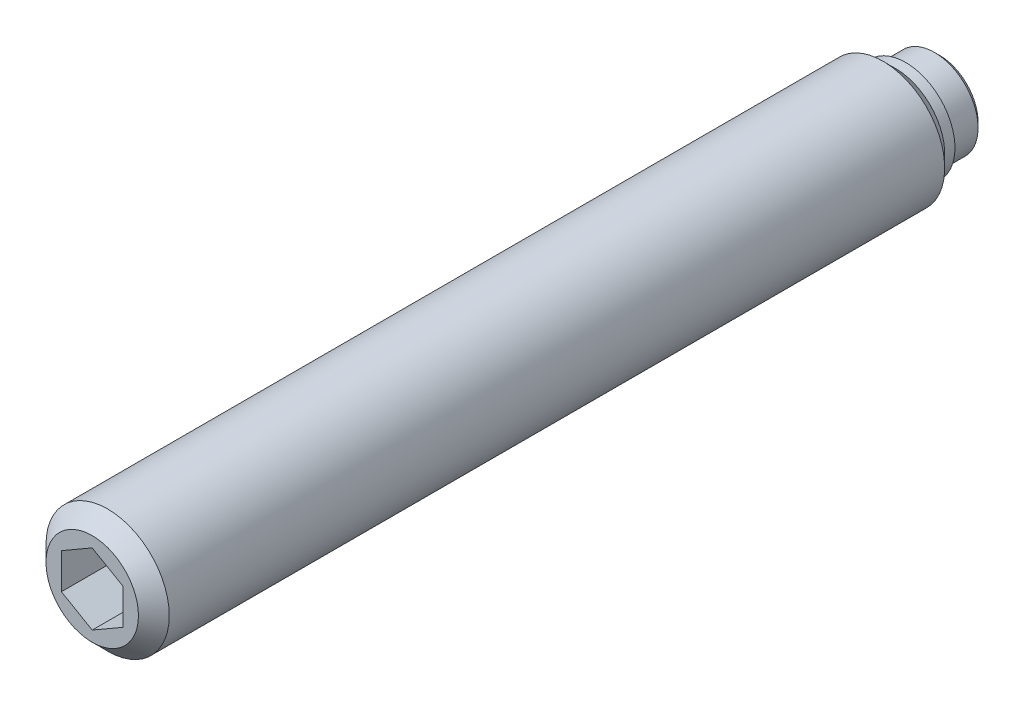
ISO-10303-21;
HEADER;
FILE_DESCRIPTION(('STEP AP214'),'2;1');
FILE_NAME('part.step','',(''),(''),'','','');
FILE_SCHEMA(('AUTOMOTIVE_DESIGN { 1 0 10303 214 1 1 1 1 }'));
ENDSEC;
DATA;
#1=APPLICATION_CONTEXT('core data for automotive mechanical design processes');
#2=APPLICATION_PROTOCOL_DEFINITION('international standard','automotive_design',2000,#1);
#3=PRODUCT_CONTEXT('',#1,'mechanical');
#4=PRODUCT('Part','Part','',(#3));
#5=PRODUCT_RELATED_PRODUCT_CATEGORY('part','',(#4));
#6=PRODUCT_DEFINITION_FORMATION('','',#4);
#7=PRODUCT_DEFINITION_CONTEXT('part definition',#1,'design');
#8=PRODUCT_DEFINITION('design','',#6,#7);
#9=PRODUCT_DEFINITION_SHAPE('','',#8);
#10=(LENGTH_UNIT() NAMED_UNIT(*) SI_UNIT(.MILLI.,.METRE.));
#11=(NAMED_UNIT(*) PLANE_ANGLE_UNIT() SI_UNIT($,.RADIAN.));
#12=(NAMED_UNIT(*) SI_UNIT($,.STERADIAN.) SOLID_ANGLE_UNIT());
#13=UNCERTAINTY_MEASURE_WITH_UNIT(LENGTH_MEASURE(1.E-05),#10,'distance_accuracy_value','');
#14=(GEOMETRIC_REPRESENTATION_CONTEXT(3) GLOBAL_UNCERTAINTY_ASSIGNED_CONTEXT((#13)) GLOBAL_UNIT_ASSIGNED_CONTEXT((#10,
#11,#12)) REPRESENTATION_CONTEXT('',''));
#15=CARTESIAN_POINT('',(0.,0.,0.));
#16=DIRECTION('',(0.,0.,1.));
#17=DIRECTION('',(1.,0.,0.));
#18=AXIS2_PLACEMENT_3D('',#15,#16,#17);
#19=CARTESIAN_POINT('',(0.,0.,3.3));
#20=DIRECTION('',(0.,0.,-1.));
#21=DIRECTION('',(-1.,0.,0.));
#22=AXIS2_PLACEMENT_3D('',#19,#20,#21);
#23=CYLINDRICAL_SURFACE('',#22,6.);
#24=CARTESIAN_POINT('',(0.,0.,5.5));
#25=DIRECTION('',(0.,0.,-1.));
#26=DIRECTION('',(-1.,0.,0.));
#27=AXIS2_PLACEMENT_3D('',#24,#25,#26);
#28=CIRCLE('',#27,6.);
#29=CARTESIAN_POINT('',(-6.,0.,5.5));
#30=VERTEX_POINT('',#29);
#31=EDGE_CURVE('E9',#30,#30,#28,.T.);
#32=ORIENTED_EDGE('',*,*,#31,.F.);
#33=EDGE_LOOP('',(#32));
#34=FACE_BOUND('',#33,.T.);
#35=CARTESIAN_POINT('',(0.,0.,81.));
#36=DIRECTION('',(0.,0.,1.));
#37=DIRECTION('',(1.,0.,0.));
#38=AXIS2_PLACEMENT_3D('',#35,#36,#37);
#39=CIRCLE('',#38,6.);
#40=CARTESIAN_POINT('',(6.,0.,81.));
#41=VERTEX_POINT('',#40);
#42=EDGE_CURVE('E123',#41,#41,#39,.T.);
#43=ORIENTED_EDGE('',*,*,#42,.F.);
#44=EDGE_LOOP('',(#43));
#45=FACE_BOUND('',#44,.T.);
#46=ADVANCED_FACE('F14',(#34,#45),#23,.T.);
#47=CARTESIAN_POINT('',(0.,0.,5.5));
#48=DIRECTION('',(0.,0.,1.));
#49=DIRECTION('',(1.,0.,0.));
#50=AXIS2_PLACEMENT_3D('',#47,#48,#49);
#51=CONICAL_SURFACE('',#50,6.,0.785398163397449);
#52=ORIENTED_EDGE('',*,*,#31,.T.);
#53=EDGE_LOOP('',(#52));
#54=FACE_BOUND('',#53,.T.);
#55=CARTESIAN_POINT('',(0.,0.,4.3));
#56=DIRECTION('',(0.,0.,-1.));
#57=DIRECTION('',(-1.,0.,0.));
#58=AXIS2_PLACEMENT_3D('',#55,#56,#57);
#59=CIRCLE('',#58,4.8);
#60=CARTESIAN_POINT('',(-4.8,0.,4.3));
#61=VERTEX_POINT('',#60);
#62=EDGE_CURVE('E21',#61,#61,#59,.T.);
#63=ORIENTED_EDGE('',*,*,#62,.F.);
#64=EDGE_LOOP('',(#63));
#65=FACE_BOUND('',#64,.T.);
#66=ADVANCED_FACE('F143',(#54,#65),#51,.T.);
#67=CARTESIAN_POINT('',(0.,0.,3.3));
#68=DIRECTION('',(0.,0.,-1.));
#69=DIRECTION('',(-1.,0.,0.));
#70=AXIS2_PLACEMENT_3D('',#67,#68,#69);
#71=CYLINDRICAL_SURFACE('',#70,4.8);
#72=ORIENTED_EDGE('',*,*,#62,.T.);
#73=EDGE_LOOP('',(#72));
#74=FACE_BOUND('',#73,.T.);
#75=CARTESIAN_POINT('',(0.,0.,3.3));
#76=DIRECTION('',(0.,0.,-1.));
#77=DIRECTION('',(-1.,0.,0.));
#78=AXIS2_PLACEMENT_3D('',#75,#76,#77);
#79=CIRCLE('',#78,4.8);
#80=CARTESIAN_POINT('',(-4.8,0.,3.3));
#81=VERTEX_POINT('',#80);
#82=EDGE_CURVE('E135',#81,#81,#79,.T.);
#83=ORIENTED_EDGE('',*,*,#82,.F.);
#84=EDGE_LOOP('',(#83));
#85=FACE_BOUND('',#84,.T.);
#86=ADVANCED_FACE('F140',(#74,#85),#71,.T.);
#87=CARTESIAN_POINT('',(0.,4.8,3.3));
#88=DIRECTION('',(0.,0.,1.));
#89=DIRECTION('',(1.,0.,0.));
#90=AXIS2_PLACEMENT_3D('',#87,#88,#89);
#91=PLANE('',#90);
#92=ORIENTED_EDGE('',*,*,#82,.T.);
#93=EDGE_LOOP('',(#92));
#94=FACE_BOUND('',#93,.T.);
#95=CARTESIAN_POINT('',(0.,0.,3.3));
#96=DIRECTION('',(0.,0.,-1.));
#97=DIRECTION('',(-1.,0.,0.));
#98=AXIS2_PLACEMENT_3D('',#95,#96,#97);
#99=CIRCLE('',#98,4.25);
#100=CARTESIAN_POINT('',(-4.25,0.,3.3));
#101=VERTEX_POINT('',#100);
#102=EDGE_CURVE('E132',#101,#101,#99,.T.);
#103=ORIENTED_EDGE('',*,*,#102,.F.);
#104=EDGE_LOOP('',(#103));
#105=FACE_BOUND('',#104,.T.);
#106=ADVANCED_FACE('F151',(#94,#105),#91,.F.);
#107=CARTESIAN_POINT('',(0.,0.,0.));
#108=DIRECTION('',(0.,0.,-1.));
#109=DIRECTION('',(-1.,0.,0.));
#110=AXIS2_PLACEMENT_3D('',#107,#108,#109);
#111=CYLINDRICAL_SURFACE('',#110,4.25);
#112=CARTESIAN_POINT('',(0.,0.,0.5));
#113=DIRECTION('',(0.,0.,-1.));
#114=DIRECTION('',(-1.,0.,0.));
#115=AXIS2_PLACEMENT_3D('',#112,#113,#114);
#116=CIRCLE('',#115,4.25);
#117=CARTESIAN_POINT('',(-4.25,0.,0.5));
#118=VERTEX_POINT('',#117);
#119=EDGE_CURVE('E129',#118,#118,#116,.T.);
#120=ORIENTED_EDGE('',*,*,#119,.F.);
#121=EDGE_LOOP('',(#120));
#122=FACE_BOUND('',#121,.T.);
#123=ORIENTED_EDGE('',*,*,#102,.T.);
#124=EDGE_LOOP('',(#123));
#125=FACE_BOUND('',#124,.T.);
#126=ADVANCED_FACE('F157',(#122,#125),#111,.T.);
#127=CARTESIAN_POINT('',(0.,0.,0.5));
#128=DIRECTION('',(0.,0.,1.));
#129=DIRECTION('',(1.,0.,0.));
#130=AXIS2_PLACEMENT_3D('',#127,#128,#129);
#131=CONICAL_SURFACE('',#130,4.25,0.785398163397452);
#132=CARTESIAN_POINT('',(0.,0.,0.));
#133=DIRECTION('',(0.,0.,-1.));
#134=DIRECTION('',(-1.,0.,0.));
#135=AXIS2_PLACEMENT_3D('',#132,#133,#134);
#136=CIRCLE('',#135,3.75);
#137=CARTESIAN_POINT('',(-3.75,0.,0.));
#138=VERTEX_POINT('',#137);
#139=EDGE_CURVE('E126',#138,#138,#136,.T.);
#140=ORIENTED_EDGE('',*,*,#139,.F.);
#141=EDGE_LOOP('',(#140));
#142=FACE_BOUND('',#141,.T.);
#143=ORIENTED_EDGE('',*,*,#119,.T.);
#144=EDGE_LOOP('',(#143));
#145=FACE_BOUND('',#144,.T.);
#146=ADVANCED_FACE('F161',(#142,#145),#131,.T.);
#147=CARTESIAN_POINT('',(0.,3.75,0.));
#148=DIRECTION('',(0.,0.,1.));
#149=DIRECTION('',(1.,0.,0.));
#150=AXIS2_PLACEMENT_3D('',#147,#148,#149);
#151=PLANE('',#150);
#152=ORIENTED_EDGE('',*,*,#139,.T.);
#153=EDGE_LOOP('',(#152));
#154=FACE_BOUND('',#153,.T.);
#155=ADVANCED_FACE('F165',(#154),#151,.F.);
#156=CARTESIAN_POINT('',(0.,0.,82.5));
#157=DIRECTION('',(0.,0.,-1.));
#158=DIRECTION('',(-1.,0.,0.));
#159=AXIS2_PLACEMENT_3D('',#156,#157,#158);
#160=CONICAL_SURFACE('',#159,4.5,0.785398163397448);
#161=ORIENTED_EDGE('',*,*,#42,.T.);
#162=EDGE_LOOP('',(#161));
#163=FACE_BOUND('',#162,.T.);
#164=CARTESIAN_POINT('',(0.,0.,82.5));
#165=DIRECTION('',(0.,0.,1.));
#166=DIRECTION('',(1.,0.,0.));
#167=AXIS2_PLACEMENT_3D('',#164,#165,#166);
#168=CIRCLE('',#167,4.5);
#169=CARTESIAN_POINT('',(4.5,0.,82.5));
#170=VERTEX_POINT('',#169);
#171=EDGE_CURVE('E115',#170,#170,#168,.T.);
#172=ORIENTED_EDGE('',*,*,#171,.F.);
#173=EDGE_LOOP('',(#172));
#174=FACE_BOUND('',#173,.T.);
#175=ADVANCED_FACE('F169',(#163,#174),#160,.T.);
#176=CARTESIAN_POINT('',(0.,-4.5,82.5));
#177=DIRECTION('',(0.,0.,1.));
#178=DIRECTION('',(1.,0.,0.));
#179=AXIS2_PLACEMENT_3D('',#176,#177,#178);
#180=PLANE('',#179);
#181=DIRECTION('',(0.866025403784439,-0.5,0.));
#182=VECTOR('',#181,1.);
#183=CARTESIAN_POINT('',(-3.,-1.73205080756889,82.5));
#184=LINE('',#183,#182);
#185=CARTESIAN_POINT('',(-3.,-1.73205080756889,82.5));
#186=VERTEX_POINT('',#185);
#187=CARTESIAN_POINT('',(0.,-3.46410161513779,82.5));
#188=VERTEX_POINT('',#187);
#189=EDGE_CURVE('E28',#186,#188,#184,.T.);
#190=ORIENTED_EDGE('',*,*,#189,.F.);
#191=DIRECTION('',(0.,-1.,0.));
#192=VECTOR('',#191,1.);
#193=CARTESIAN_POINT('',(-3.,1.73205080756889,82.5));
#194=LINE('',#193,#192);
#195=CARTESIAN_POINT('',(-3.,1.73205080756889,82.5));
#196=VERTEX_POINT('',#195);
#197=EDGE_CURVE('E111',#196,#186,#194,.T.);
#198=ORIENTED_EDGE('',*,*,#197,.F.);
#199=DIRECTION('',(-0.866025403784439,-0.5,0.));
#200=VECTOR('',#199,1.);
#201=CARTESIAN_POINT('',(0.,3.46410161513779,82.5));
#202=LINE('',#201,#200);
#203=CARTESIAN_POINT('',(0.,3.46410161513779,82.5));
#204=VERTEX_POINT('',#203);
#205=EDGE_CURVE('E109',#204,#196,#202,.T.);
#206=ORIENTED_EDGE('',*,*,#205,.F.);
#207=DIRECTION('',(-0.866025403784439,0.5,0.));
#208=VECTOR('',#207,1.);
#209=CARTESIAN_POINT('',(3.,1.73205080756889,82.5));
#210=LINE('',#209,#208);
#211=CARTESIAN_POINT('',(3.,1.73205080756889,82.5));
#212=VERTEX_POINT('',#211);
#213=EDGE_CURVE('E76',#212,#204,#210,.T.);
#214=ORIENTED_EDGE('',*,*,#213,.F.);
#215=DIRECTION('',(0.,1.,0.));
#216=VECTOR('',#215,1.);
#217=CARTESIAN_POINT('',(3.,-1.73205080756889,82.5));
#218=LINE('',#217,#216);
#219=CARTESIAN_POINT('',(3.,-1.73205080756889,82.5));
#220=VERTEX_POINT('',#219);
#221=EDGE_CURVE('E105',#220,#212,#218,.T.);
#222=ORIENTED_EDGE('',*,*,#221,.F.);
#223=DIRECTION('',(0.866025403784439,0.5,0.));
#224=VECTOR('',#223,1.);
#225=CARTESIAN_POINT('',(0.,-3.46410161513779,82.5));
#226=LINE('',#225,#224);
#227=EDGE_CURVE('E102',#188,#220,#226,.T.);
#228=ORIENTED_EDGE('',*,*,#227,.F.);
#229=EDGE_LOOP('',(#190,#198,#206,#214,#222,#228));
#230=FACE_BOUND('',#229,.T.);
#231=ORIENTED_EDGE('',*,*,#171,.T.);
#232=EDGE_LOOP('',(#231));
#233=FACE_BOUND('',#232,.T.);
#234=ADVANCED_FACE('F173',(#230,#233),#180,.T.);
#235=CARTESIAN_POINT('',(-3.,-1.73205080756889,74.5));
#236=DIRECTION('',(-0.5,-0.866025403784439,0.));
#237=DIRECTION('',(0.866025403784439,-0.5,0.));
#238=AXIS2_PLACEMENT_3D('',#235,#236,#237);
#239=PLANE('',#238);
#240=ORIENTED_EDGE('',*,*,#189,.T.);
#241=DIRECTION('',(0.,0.,1.));
#242=VECTOR('',#241,1.);
#243=CARTESIAN_POINT('',(0.,-3.46410161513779,74.5));
#244=LINE('',#243,#242);
#245=CARTESIAN_POINT('',(0.,-3.46410161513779,74.5));
#246=VERTEX_POINT('',#245);
#247=EDGE_CURVE('E58',#246,#188,#244,.T.);
#248=ORIENTED_EDGE('',*,*,#247,.F.);
#249=DIRECTION('',(0.866025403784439,-0.5,0.));
#250=VECTOR('',#249,1.);
#251=CARTESIAN_POINT('',(-3.,-1.73205080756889,74.5));
#252=LINE('',#251,#250);
#253=CARTESIAN_POINT('',(-3.,-1.73205080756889,74.5));
#254=VERTEX_POINT('',#253);
#255=EDGE_CURVE('E113',#254,#246,#252,.T.);
#256=ORIENTED_EDGE('',*,*,#255,.F.);
#257=DIRECTION('',(0.,0.,1.));
#258=VECTOR('',#257,1.);
#259=CARTESIAN_POINT('',(-3.,-1.73205080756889,74.5));
#260=LINE('',#259,#258);
#261=EDGE_CURVE('E36',#254,#186,#260,.T.);
#262=ORIENTED_EDGE('',*,*,#261,.T.);
#263=EDGE_LOOP('',(#240,#248,#256,#262));
#264=FACE_BOUND('',#263,.T.);
#265=ADVANCED_FACE('F177',(#264),#239,.F.);
#266=CARTESIAN_POINT('',(-3.,1.73205080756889,74.5));
#267=DIRECTION('',(-1.,0.,0.));
#268=DIRECTION('',(0.,0.,1.));
#269=AXIS2_PLACEMENT_3D('',#266,#267,#268);
#270=PLANE('',#269);
#271=ORIENTED_EDGE('',*,*,#197,.T.);
#272=ORIENTED_EDGE('',*,*,#261,.F.);
#273=DIRECTION('',(0.,-1.,0.));
#274=VECTOR('',#273,1.);
#275=CARTESIAN_POINT('',(-3.,1.73205080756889,74.5));
#276=LINE('',#275,#274);
#277=CARTESIAN_POINT('',(-3.,1.73205080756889,74.5));
#278=VERTEX_POINT('',#277);
#279=EDGE_CURVE('E88',#278,#254,#276,.T.);
#280=ORIENTED_EDGE('',*,*,#279,.F.);
#281=DIRECTION('',(0.,0.,1.));
#282=VECTOR('',#281,1.);
#283=CARTESIAN_POINT('',(-3.,1.73205080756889,74.5));
#284=LINE('',#283,#282);
#285=EDGE_CURVE('E80',#278,#196,#284,.T.);
#286=ORIENTED_EDGE('',*,*,#285,.T.);
#287=EDGE_LOOP('',(#271,#272,#280,#286));
#288=FACE_BOUND('',#287,.T.);
#289=ADVANCED_FACE('F181',(#288),#270,.F.);
#290=CARTESIAN_POINT('',(0.,3.46410161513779,74.5));
#291=DIRECTION('',(-0.5,0.866025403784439,0.));
#292=DIRECTION('',(-0.866025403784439,-0.5,0.));
#293=AXIS2_PLACEMENT_3D('',#290,#291,#292);
#294=PLANE('',#293);
#295=ORIENTED_EDGE('',*,*,#205,.T.);
#296=ORIENTED_EDGE('',*,*,#285,.F.);
#297=DIRECTION('',(-0.866025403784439,-0.5,0.));
#298=VECTOR('',#297,1.);
#299=CARTESIAN_POINT('',(0.,3.46410161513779,74.5));
#300=LINE('',#299,#298);
#301=CARTESIAN_POINT('',(0.,3.46410161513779,74.5));
#302=VERTEX_POINT('',#301);
#303=EDGE_CURVE('E84',#302,#278,#300,.T.);
#304=ORIENTED_EDGE('',*,*,#303,.F.);
#305=DIRECTION('',(0.,0.,1.));
#306=VECTOR('',#305,1.);
#307=CARTESIAN_POINT('',(0.,3.46410161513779,74.5));
#308=LINE('',#307,#306);
#309=EDGE_CURVE('E69',#302,#204,#308,.T.);
#310=ORIENTED_EDGE('',*,*,#309,.T.);
#311=EDGE_LOOP('',(#295,#296,#304,#310));
#312=FACE_BOUND('',#311,.T.);
#313=ADVANCED_FACE('F85',(#312),#294,.F.);
#314=CARTESIAN_POINT('',(3.,1.73205080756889,74.5));
#315=DIRECTION('',(0.5,0.866025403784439,0.));
#316=DIRECTION('',(-0.866025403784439,0.5,0.));
#317=AXIS2_PLACEMENT_3D('',#314,#315,#316);
#318=PLANE('',#317);
#319=ORIENTED_EDGE('',*,*,#213,.T.);
#320=ORIENTED_EDGE('',*,*,#309,.F.);
#321=DIRECTION('',(-0.866025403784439,0.5,0.));
#322=VECTOR('',#321,1.);
#323=CARTESIAN_POINT('',(3.,1.73205080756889,74.5));
#324=LINE('',#323,#322);
#325=CARTESIAN_POINT('',(3.,1.73205080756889,74.5));
#326=VERTEX_POINT('',#325);
#327=EDGE_CURVE('E73',#326,#302,#324,.T.);
#328=ORIENTED_EDGE('',*,*,#327,.F.);
#329=DIRECTION('',(0.,0.,1.));
#330=VECTOR('',#329,1.);
#331=CARTESIAN_POINT('',(3.,1.73205080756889,74.5));
#332=LINE('',#331,#330);
#333=EDGE_CURVE('E81',#326,#212,#332,.T.);
#334=ORIENTED_EDGE('',*,*,#333,.T.);
#335=EDGE_LOOP('',(#319,#320,#328,#334));
#336=FACE_BOUND('',#335,.T.);
#337=ADVANCED_FACE('F71',(#336),#318,.F.);
#338=CARTESIAN_POINT('',(3.,-1.73205080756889,74.5));
#339=DIRECTION('',(1.,0.,0.));
#340=DIRECTION('',(0.,0.,-1.));
#341=AXIS2_PLACEMENT_3D('',#338,#339,#340);
#342=PLANE('',#341);
#343=ORIENTED_EDGE('',*,*,#221,.T.);
#344=ORIENTED_EDGE('',*,*,#333,.F.);
#345=DIRECTION('',(0.,1.,0.));
#346=VECTOR('',#345,1.);
#347=CARTESIAN_POINT('',(3.,-1.73205080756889,74.5));
#348=LINE('',#347,#346);
#349=CARTESIAN_POINT('',(3.,-1.73205080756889,74.5));
#350=VERTEX_POINT('',#349);
#351=EDGE_CURVE('E94',#350,#326,#348,.T.);
#352=ORIENTED_EDGE('',*,*,#351,.F.);
#353=DIRECTION('',(0.,0.,1.));
#354=VECTOR('',#353,1.);
#355=CARTESIAN_POINT('',(3.,-1.73205080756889,74.5));
#356=LINE('',#355,#354);
#357=EDGE_CURVE('E118',#350,#220,#356,.T.);
#358=ORIENTED_EDGE('',*,*,#357,.T.);
#359=EDGE_LOOP('',(#343,#344,#352,#358));
#360=FACE_BOUND('',#359,.T.);
#361=ADVANCED_FACE('F185',(#360),#342,.F.);
#362=CARTESIAN_POINT('',(0.,-3.46410161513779,74.5));
#363=DIRECTION('',(0.5,-0.866025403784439,0.));
#364=DIRECTION('',(0.866025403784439,0.5,0.));
#365=AXIS2_PLACEMENT_3D('',#362,#363,#364);
#366=PLANE('',#365);
#367=ORIENTED_EDGE('',*,*,#227,.T.);
#368=ORIENTED_EDGE('',*,*,#357,.F.);
#369=DIRECTION('',(0.866025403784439,0.5,0.));
#370=VECTOR('',#369,1.);
#371=CARTESIAN_POINT('',(0.,-3.46410161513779,74.5));
#372=LINE('',#371,#370);
#373=EDGE_CURVE('E96',#246,#350,#372,.T.);
#374=ORIENTED_EDGE('',*,*,#373,.F.);
#375=ORIENTED_EDGE('',*,*,#247,.T.);
#376=EDGE_LOOP('',(#367,#368,#374,#375));
#377=FACE_BOUND('',#376,.T.);
#378=ADVANCED_FACE('F182',(#377),#366,.F.);
#379=CARTESIAN_POINT('',(0.,0.,74.5));
#380=DIRECTION('',(0.,0.,1.));
#381=DIRECTION('',(1.,0.,0.));
#382=AXIS2_PLACEMENT_3D('',#379,#380,#381);
#383=PLANE('',#382);
#384=ORIENTED_EDGE('',*,*,#255,.T.);
#385=ORIENTED_EDGE('',*,*,#373,.T.);
#386=ORIENTED_EDGE('',*,*,#351,.T.);
#387=ORIENTED_EDGE('',*,*,#327,.T.);
#388=ORIENTED_EDGE('',*,*,#303,.T.);
#389=ORIENTED_EDGE('',*,*,#279,.T.);
#390=EDGE_LOOP('',(#384,#385,#386,#387,#388,#389));
#391=FACE_BOUND('',#390,.T.);
#392=ADVANCED_FACE('F91',(#391),#383,.T.);
#393=CLOSED_SHELL('',(#46,#66,#86,#106,#126,#146,#155,#175,#234,#265,#289,#313,#337,#361,#378,#392));
#394=MANIFOLD_SOLID_BREP('B1',#393);
#395=ADVANCED_BREP_SHAPE_REPRESENTATION('',(#18,#394),#14);
#396=SHAPE_DEFINITION_REPRESENTATION(#9,#395);
ENDSEC;
END-ISO-10303-21;
